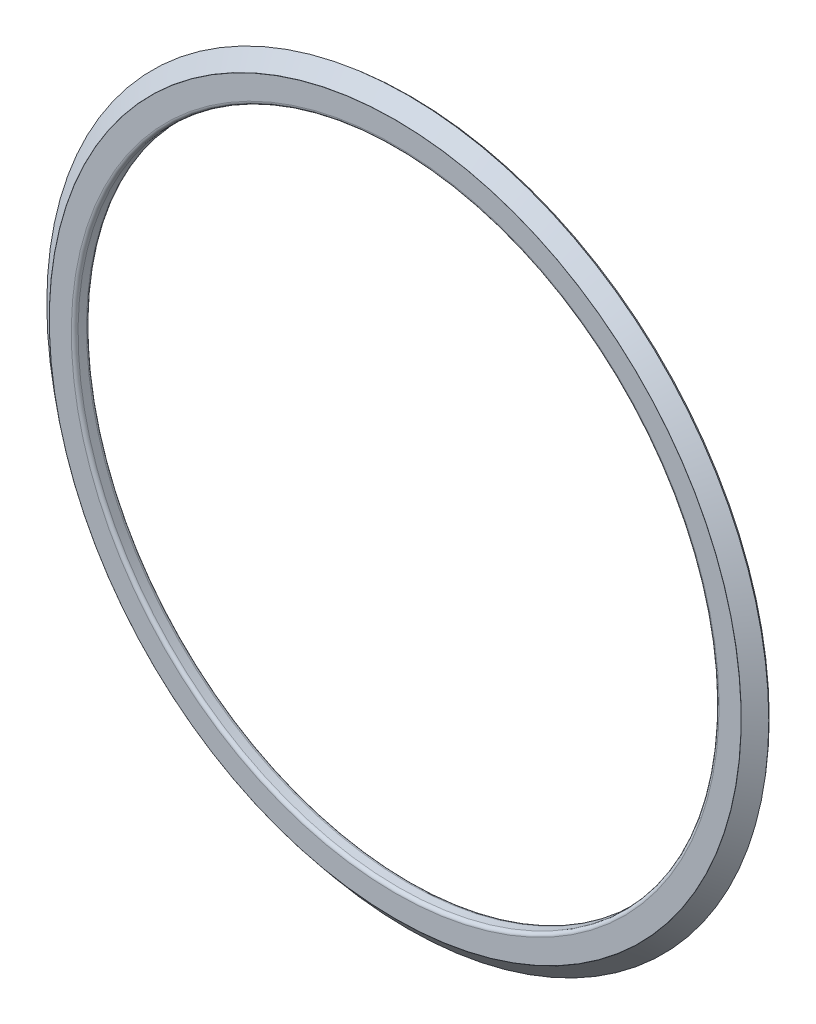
ISO-10303-21;
HEADER;
FILE_DESCRIPTION(('STEP AP214'),'2;1');
FILE_NAME('part.step','',(''),(''),'','','');
FILE_SCHEMA(('AUTOMOTIVE_DESIGN { 1 0 10303 214 1 1 1 1 }'));
ENDSEC;
DATA;
#1=APPLICATION_CONTEXT('core data for automotive mechanical design processes');
#2=APPLICATION_PROTOCOL_DEFINITION('international standard','automotive_design',2000,#1);
#3=PRODUCT_CONTEXT('',#1,'mechanical');
#4=PRODUCT('Part','Part','',(#3));
#5=PRODUCT_RELATED_PRODUCT_CATEGORY('part','',(#4));
#6=PRODUCT_DEFINITION_FORMATION('','',#4);
#7=PRODUCT_DEFINITION_CONTEXT('part definition',#1,'design');
#8=PRODUCT_DEFINITION('design','',#6,#7);
#9=PRODUCT_DEFINITION_SHAPE('','',#8);
#10=(LENGTH_UNIT() NAMED_UNIT(*) SI_UNIT(.MILLI.,.METRE.));
#11=(NAMED_UNIT(*) PLANE_ANGLE_UNIT() SI_UNIT($,.RADIAN.));
#12=(NAMED_UNIT(*) SI_UNIT($,.STERADIAN.) SOLID_ANGLE_UNIT());
#13=UNCERTAINTY_MEASURE_WITH_UNIT(LENGTH_MEASURE(1.E-05),#10,'distance_accuracy_value','');
#14=(GEOMETRIC_REPRESENTATION_CONTEXT(3) GLOBAL_UNCERTAINTY_ASSIGNED_CONTEXT((#13)) GLOBAL_UNIT_ASSIGNED_CONTEXT((#10,
#11,#12)) REPRESENTATION_CONTEXT('',''));
#15=CARTESIAN_POINT('',(0.,0.,0.));
#16=DIRECTION('',(0.,0.,1.));
#17=DIRECTION('',(1.,0.,0.));
#18=AXIS2_PLACEMENT_3D('',#15,#16,#17);
#19=CARTESIAN_POINT('',(0.,5.846852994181E-07,33.5));
#20=DIRECTION('',(0.,-1.74532925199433E-08,-1.));
#21=DIRECTION('',(-0.00155633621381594,-0.999998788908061,1.74532713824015E-08));
#22=AXIS2_PLACEMENT_3D('',#19,#20,#21);
#23=TOROIDAL_SURFACE('',#22,96.,1.);
#24=CARTESIAN_POINT('',(0.,5.846852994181E-07,33.5));
#25=DIRECTION('',(0.,1.74532925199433E-08,1.));
#26=DIRECTION('',(0.,-1.,1.74532925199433E-08));
#27=AXIS2_PLACEMENT_3D('',#24,#25,#26);
#28=CIRCLE('',#27,95.);
#29=CARTESIAN_POINT('',(0.,-94.9999994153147,33.5000016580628));
#30=VERTEX_POINT('',#29);
#31=EDGE_CURVE('E29',#30,#30,#28,.T.);
#32=ORIENTED_EDGE('',*,*,#31,.F.);
#33=EDGE_LOOP('',(#32));
#34=FACE_BOUND('',#33,.T.);
#35=CARTESIAN_POINT('',(0.,6.02138591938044E-07,34.5));
#36=DIRECTION('',(0.,1.74532925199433E-08,1.));
#37=DIRECTION('',(-1.,0.,0.));
#38=AXIS2_PLACEMENT_3D('',#35,#36,#37);
#39=CIRCLE('',#38,96.);
#40=CARTESIAN_POINT('',(0.,-95.9999993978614,34.5000016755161));
#41=VERTEX_POINT('',#40);
#42=EDGE_CURVE('E11',#41,#41,#39,.T.);
#43=ORIENTED_EDGE('',*,*,#42,.T.);
#44=EDGE_LOOP('',(#43));
#45=FACE_BOUND('',#44,.T.);
#46=ADVANCED_FACE('F18',(#34,#45),#23,.T.);
#47=CARTESIAN_POINT('',(0.,6.06065582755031E-07,34.725));
#48=DIRECTION('',(0.,-1.74532925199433E-08,-1.));
#49=DIRECTION('',(0.,-1.,1.74532925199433E-08));
#50=AXIS2_PLACEMENT_3D('',#47,#48,#49);
#51=CYLINDRICAL_SURFACE('',#50,95.);
#52=CARTESIAN_POINT('',(0.,5.41052068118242E-07,31.));
#53=DIRECTION('',(0.,1.74532925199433E-08,1.));
#54=DIRECTION('',(0.,-1.,1.74532925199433E-08));
#55=AXIS2_PLACEMENT_3D('',#52,#53,#54);
#56=CIRCLE('',#55,95.);
#57=CARTESIAN_POINT('',(0.,-94.9999994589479,31.0000016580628));
#58=VERTEX_POINT('',#57);
#59=EDGE_CURVE('E166',#58,#58,#56,.T.);
#60=ORIENTED_EDGE('',*,*,#59,.F.);
#61=EDGE_LOOP('',(#60));
#62=FACE_BOUND('',#61,.T.);
#63=ORIENTED_EDGE('',*,*,#31,.T.);
#64=EDGE_LOOP('',(#63));
#65=FACE_BOUND('',#64,.T.);
#66=ADVANCED_FACE('F212',(#62,#65),#51,.F.);
#67=CARTESIAN_POINT('',(0.,5.41052068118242E-07,31.));
#68=DIRECTION('',(0.,-1.74532925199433E-08,-1.));
#69=DIRECTION('',(-0.00229932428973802,-0.999997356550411,1.74532463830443E-08));
#70=AXIS2_PLACEMENT_3D('',#67,#68,#69);
#71=TOROIDAL_SURFACE('',#70,96.,1.);
#72=CARTESIAN_POINT('',(0.,5.23598775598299E-07,30.));
#73=DIRECTION('',(0.,1.74532925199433E-08,1.));
#74=DIRECTION('',(-1.,0.,0.));
#75=AXIS2_PLACEMENT_3D('',#72,#73,#74);
#76=CIRCLE('',#75,96.);
#77=CARTESIAN_POINT('',(0.,-95.9999994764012,30.0000016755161));
#78=VERTEX_POINT('',#77);
#79=EDGE_CURVE('E141',#78,#78,#76,.T.);
#80=ORIENTED_EDGE('',*,*,#79,.F.);
#81=EDGE_LOOP('',(#80));
#82=FACE_BOUND('',#81,.T.);
#83=ORIENTED_EDGE('',*,*,#59,.T.);
#84=EDGE_LOOP('',(#83));
#85=FACE_BOUND('',#84,.T.);
#86=ADVANCED_FACE('F20',(#82,#85),#71,.T.);
#87=CARTESIAN_POINT('',(0.,5.23598775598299E-07,30.));
#88=DIRECTION('',(0.,-1.74532925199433E-08,-1.));
#89=DIRECTION('',(0.,-1.,1.74532925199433E-08));
#90=AXIS2_PLACEMENT_3D('',#87,#88,#89);
#91=PLANE('',#90);
#92=CARTESIAN_POINT('',(0.,5.23598775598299E-07,30.));
#93=DIRECTION('',(0.,1.74532925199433E-08,1.));
#94=DIRECTION('',(0.,-1.,1.74532925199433E-08));
#95=AXIS2_PLACEMENT_3D('',#92,#93,#94);
#96=CIRCLE('',#95,97.5);
#97=CARTESIAN_POINT('',(0.,-97.4999994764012,30.000001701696));
#98=VERTEX_POINT('',#97);
#99=EDGE_CURVE('E142',#98,#98,#96,.T.);
#100=ORIENTED_EDGE('',*,*,#99,.F.);
#101=EDGE_LOOP('',(#100));
#102=FACE_BOUND('',#101,.T.);
#103=ORIENTED_EDGE('',*,*,#79,.T.);
#104=EDGE_LOOP('',(#103));
#105=FACE_BOUND('',#104,.T.);
#106=ADVANCED_FACE('F208',(#102,#105),#91,.T.);
#107=CARTESIAN_POINT('',(0.,6.06065582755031E-07,34.725));
#108=DIRECTION('',(0.,-1.74532925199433E-08,-1.));
#109=DIRECTION('',(0.,-1.,1.74532925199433E-08));
#110=AXIS2_PLACEMENT_3D('',#107,#108,#109);
#111=CYLINDRICAL_SURFACE('',#110,97.5);
#112=CARTESIAN_POINT('',(0.,5.37561409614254E-07,30.8));
#113=DIRECTION('',(0.,-1.74532925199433E-08,-1.));
#114=DIRECTION('',(0.,-1.,1.74532925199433E-08));
#115=AXIS2_PLACEMENT_3D('',#112,#113,#114);
#116=CIRCLE('',#115,97.5);
#117=CARTESIAN_POINT('',(0.,97.5000005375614,30.799998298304));
#118=VERTEX_POINT('',#117);
#119=EDGE_CURVE('E137',#118,#118,#116,.T.);
#120=ORIENTED_EDGE('',*,*,#119,.T.);
#121=EDGE_LOOP('',(#120));
#122=FACE_BOUND('',#121,.T.);
#123=ORIENTED_EDGE('',*,*,#99,.T.);
#124=EDGE_LOOP('',(#123));
#125=FACE_BOUND('',#124,.T.);
#126=ADVANCED_FACE('F254',(#122,#125),#111,.T.);
#127=CARTESIAN_POINT('',(0.,5.37561409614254E-07,30.8));
#128=DIRECTION('',(0.,-1.74532925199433E-08,-1.));
#129=DIRECTION('',(0.,-1.,1.74532925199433E-08));
#130=AXIS2_PLACEMENT_3D('',#127,#128,#129);
#131=PLANE('',#130);
#132=CARTESIAN_POINT('',(0.,5.37561409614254E-07,30.8));
#133=DIRECTION('',(0.,-1.74532925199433E-08,-1.));
#134=DIRECTION('',(0.,-1.,1.74532925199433E-08));
#135=AXIS2_PLACEMENT_3D('',#132,#133,#134);
#136=CIRCLE('',#135,100.399999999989);
#137=CARTESIAN_POINT('',(0.,-100.399999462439,30.8000017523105));
#138=VERTEX_POINT('',#137);
#139=EDGE_CURVE('E165',#138,#138,#136,.T.);
#140=ORIENTED_EDGE('',*,*,#139,.T.);
#141=EDGE_LOOP('',(#140));
#142=FACE_BOUND('',#141,.T.);
#143=ORIENTED_EDGE('',*,*,#119,.F.);
#144=EDGE_LOOP('',(#143));
#145=FACE_BOUND('',#144,.T.);
#146=ADVANCED_FACE('F230',(#142,#145),#131,.T.);
#147=CARTESIAN_POINT('',(0.,5.21853446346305E-07,29.9));
#148=DIRECTION('',(0.,-1.74532925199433E-08,-1.));
#149=DIRECTION('',(0.,-1.,1.74532925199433E-08));
#150=AXIS2_PLACEMENT_3D('',#147,#148,#149);
#151=CONICAL_SURFACE('',#150,101.9588457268,1.0471975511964);
#152=CARTESIAN_POINT('',(0.,5.06145483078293E-07,28.9999999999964));
#153=DIRECTION('',(0.,-1.74532925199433E-08,-1.));
#154=DIRECTION('',(0.,1.,-1.74532925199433E-08));
#155=AXIS2_PLACEMENT_3D('',#152,#153,#154);
#156=CIRCLE('',#155,103.517691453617);
#157=CARTESIAN_POINT('',(0.,-103.517690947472,29.000001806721));
#158=VERTEX_POINT('',#157);
#159=EDGE_CURVE('E161',#158,#158,#156,.T.);
#160=ORIENTED_EDGE('',*,*,#159,.T.);
#161=EDGE_LOOP('',(#160));
#162=FACE_BOUND('',#161,.T.);
#163=ORIENTED_EDGE('',*,*,#139,.F.);
#164=EDGE_LOOP('',(#163));
#165=FACE_BOUND('',#164,.T.);
#166=ADVANCED_FACE('F226',(#162,#165),#151,.F.);
#167=CARTESIAN_POINT('',(0.,5.11071399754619E-07,29.282234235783));
#168=DIRECTION('',(0.,1.74532925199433E-08,1.));
#169=DIRECTION('',(0.,1.,-1.74532925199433E-08));
#170=AXIS2_PLACEMENT_3D('',#167,#168,#169);
#171=CONICAL_SURFACE('',#170,103.7080608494,0.59341194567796);
#172=ORIENTED_EDGE('',*,*,#159,.F.);
#173=EDGE_LOOP('',(#172));
#174=FACE_BOUND('',#173,.T.);
#175=CARTESIAN_POINT('',(0.,5.15997316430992E-07,29.5644684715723));
#176=DIRECTION('',(0.,-1.74532925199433E-08,-1.));
#177=DIRECTION('',(0.,1.,-1.74532925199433E-08));
#178=AXIS2_PLACEMENT_3D('',#175,#176,#177);
#179=CIRCLE('',#178,103.898430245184);
#180=CARTESIAN_POINT('',(0.,103.898430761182,29.5644666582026));
#181=VERTEX_POINT('',#180);
#182=EDGE_CURVE('E153',#181,#181,#179,.T.);
#183=ORIENTED_EDGE('',*,*,#182,.T.);
#184=EDGE_LOOP('',(#183));
#185=FACE_BOUND('',#184,.T.);
#186=ADVANCED_FACE('F229',(#174,#185),#171,.T.);
#187=CARTESIAN_POINT('',(0.,5.4161466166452E-07,31.032234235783));
#188=DIRECTION('',(0.,-1.74532925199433E-08,-1.));
#189=DIRECTION('',(0.,-1.,1.74532925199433E-08));
#190=AXIS2_PLACEMENT_3D('',#187,#188,#189);
#191=CONICAL_SURFACE('',#190,102.1492151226,0.872664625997);
#192=CARTESIAN_POINT('',(0.,5.67232006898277E-07,32.5000000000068));
#193=DIRECTION('',(0.,-1.74532925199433E-08,-1.));
#194=DIRECTION('',(0.,-1.,1.74532925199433E-08));
#195=AXIS2_PLACEMENT_3D('',#192,#193,#194);
#196=CIRCLE('',#195,100.4);
#197=CARTESIAN_POINT('',(0.,-100.399999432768,32.5000017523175));
#198=VERTEX_POINT('',#197);
#199=EDGE_CURVE('E149',#198,#198,#196,.T.);
#200=ORIENTED_EDGE('',*,*,#199,.T.);
#201=EDGE_LOOP('',(#200));
#202=FACE_BOUND('',#201,.T.);
#203=ORIENTED_EDGE('',*,*,#182,.F.);
#204=EDGE_LOOP('',(#203));
#205=FACE_BOUND('',#204,.T.);
#206=ADVANCED_FACE('F264',(#202,#205),#191,.T.);
#207=CARTESIAN_POINT('',(0.,5.88612290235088E-07,33.725));
#208=DIRECTION('',(0.,-1.74532925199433E-08,-1.));
#209=DIRECTION('',(0.,-1.,1.74532925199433E-08));
#210=AXIS2_PLACEMENT_3D('',#207,#208,#209);
#211=CYLINDRICAL_SURFACE('',#210,100.4);
#212=CARTESIAN_POINT('',(0.,5.82939970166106E-07,33.4));
#213=DIRECTION('',(0.,1.74532925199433E-08,1.));
#214=DIRECTION('',(0.,-1.,1.74532925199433E-08));
#215=AXIS2_PLACEMENT_3D('',#212,#213,#214);
#216=CIRCLE('',#215,100.4);
#217=CARTESIAN_POINT('',(0.,-100.39999941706,33.4000017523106));
#218=VERTEX_POINT('',#217);
#219=EDGE_CURVE('E159',#218,#218,#216,.T.);
#220=ORIENTED_EDGE('',*,*,#219,.F.);
#221=EDGE_LOOP('',(#220));
#222=FACE_BOUND('',#221,.T.);
#223=ORIENTED_EDGE('',*,*,#199,.F.);
#224=EDGE_LOOP('',(#223));
#225=FACE_BOUND('',#224,.T.);
#226=ADVANCED_FACE('F266',(#222,#225),#211,.T.);
#227=CARTESIAN_POINT('',(0.,5.82939970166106E-07,33.4));
#228=DIRECTION('',(0.,-1.74532925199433E-08,-1.));
#229=DIRECTION('',(-0.00217565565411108,-0.999997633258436,1.74532512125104E-08));
#230=AXIS2_PLACEMENT_3D('',#227,#228,#229);
#231=TOROIDAL_SURFACE('',#230,100.3,0.1);
#232=CARTESIAN_POINT('',(0.,5.846852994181E-07,33.5));
#233=DIRECTION('',(0.,-1.74532925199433E-08,-1.));
#234=DIRECTION('',(-1.,0.,0.));
#235=AXIS2_PLACEMENT_3D('',#232,#233,#234);
#236=CIRCLE('',#235,100.3);
#237=CARTESIAN_POINT('',(1.392902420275E-12,-100.299999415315,33.5000017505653));
#238=VERTEX_POINT('',#237);
#239=EDGE_CURVE('E154',#238,#238,#236,.T.);
#240=ORIENTED_EDGE('',*,*,#239,.T.);
#241=EDGE_LOOP('',(#240));
#242=FACE_BOUND('',#241,.T.);
#243=ORIENTED_EDGE('',*,*,#219,.T.);
#244=EDGE_LOOP('',(#243));
#245=FACE_BOUND('',#244,.T.);
#246=ADVANCED_FACE('F224',(#242,#245),#231,.T.);
#247=CARTESIAN_POINT('',(0.,5.846852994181E-07,33.5));
#248=DIRECTION('',(0.,-1.74532925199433E-08,-1.));
#249=DIRECTION('',(0.,-1.,1.74532925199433E-08));
#250=AXIS2_PLACEMENT_3D('',#247,#248,#249);
#251=PLANE('',#250);
#252=CARTESIAN_POINT('',(0.,5.846852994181E-07,33.5));
#253=DIRECTION('',(0.,-1.74532925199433E-08,-1.));
#254=DIRECTION('',(0.,-1.,1.74532925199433E-08));
#255=AXIS2_PLACEMENT_3D('',#252,#253,#254);
#256=CIRCLE('',#255,102.186074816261);
#257=CARTESIAN_POINT('',(0.,-102.186074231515,33.5000017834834));
#258=VERTEX_POINT('',#257);
#259=EDGE_CURVE('E155',#258,#258,#256,.T.);
#260=ORIENTED_EDGE('',*,*,#259,.T.);
#261=EDGE_LOOP('',(#260));
#262=FACE_BOUND('',#261,.T.);
#263=ORIENTED_EDGE('',*,*,#239,.F.);
#264=EDGE_LOOP('',(#263));
#265=FACE_BOUND('',#264,.T.);
#266=ADVANCED_FACE('F258',(#262,#265),#251,.T.);
#267=CARTESIAN_POINT('',(0.,5.541420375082E-07,31.75));
#268=DIRECTION('',(0.,-1.74532925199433E-08,-1.));
#269=DIRECTION('',(0.,-1.,1.74532925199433E-08));
#270=AXIS2_PLACEMENT_3D('',#267,#268,#269);
#271=CONICAL_SURFACE('',#270,104.2716436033,0.872664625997);
#272=CARTESIAN_POINT('',(0.,5.23598775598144E-07,29.9999999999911));
#273=DIRECTION('',(0.,-1.74532925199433E-08,-1.));
#274=DIRECTION('',(0.,1.,-1.74532925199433E-08));
#275=AXIS2_PLACEMENT_3D('',#272,#273,#274);
#276=CIRCLE('',#275,106.35721239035);
#277=CARTESIAN_POINT('',(0.,-106.357211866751,30.0000018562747));
#278=VERTEX_POINT('',#277);
#279=EDGE_CURVE('E160',#278,#278,#276,.T.);
#280=ORIENTED_EDGE('',*,*,#279,.T.);
#281=EDGE_LOOP('',(#280));
#282=FACE_BOUND('',#281,.T.);
#283=ORIENTED_EDGE('',*,*,#259,.F.);
#284=EDGE_LOOP('',(#283));
#285=FACE_BOUND('',#284,.T.);
#286=ADVANCED_FACE('F236',(#282,#285),#271,.F.);
#287=CARTESIAN_POINT('',(0.,5.30283774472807E-07,30.383022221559));
#288=DIRECTION('',(0.,1.74532925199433E-08,1.));
#289=DIRECTION('',(0.,1.,-1.74532925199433E-08));
#290=AXIS2_PLACEMENT_3D('',#287,#288,#289);
#291=CONICAL_SURFACE('',#290,106.6786061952,0.6981317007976);
#292=ORIENTED_EDGE('',*,*,#279,.F.);
#293=EDGE_LOOP('',(#292));
#294=FACE_BOUND('',#293,.T.);
#295=CARTESIAN_POINT('',(0.,5.36968773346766E-07,30.7660444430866));
#296=DIRECTION('',(0.,1.74532925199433E-08,1.));
#297=DIRECTION('',(0.,1.,-1.74532925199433E-08));
#298=AXIS2_PLACEMENT_3D('',#295,#296,#297);
#299=CIRCLE('',#298,107.000000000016);
#300=CARTESIAN_POINT('',(0.,107.000000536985,30.7660425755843));
#301=VERTEX_POINT('',#300);
#302=EDGE_CURVE('E170',#301,#301,#299,.T.);
#303=ORIENTED_EDGE('',*,*,#302,.F.);
#304=EDGE_LOOP('',(#303));
#305=FACE_BOUND('',#304,.T.);
#306=ADVANCED_FACE('F232',(#294,#305),#291,.T.);
#307=CARTESIAN_POINT('',(0.,5.69349517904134E-07,32.621324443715));
#308=DIRECTION('',(0.,-1.74532925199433E-08,-1.));
#309=DIRECTION('',(0.,-1.,1.74532925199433E-08));
#310=AXIS2_PLACEMENT_3D('',#307,#308,#309);
#311=CONICAL_SURFACE('',#310,104.788963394,0.872664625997);
#312=CARTESIAN_POINT('',(0.,6.01730262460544E-07,34.4766044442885));
#313=DIRECTION('',(0.,1.74532925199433E-08,1.));
#314=DIRECTION('',(0.,-1.,1.74532925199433E-08));
#315=AXIS2_PLACEMENT_3D('',#312,#313,#314);
#316=CIRCLE('',#315,102.577926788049);
#317=CARTESIAN_POINT('',(3.769218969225E-13,102.57792738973,34.4766026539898));
#318=VERTEX_POINT('',#317);
#319=EDGE_CURVE('E146',#318,#318,#316,.T.);
#320=ORIENTED_EDGE('',*,*,#319,.F.);
#321=EDGE_LOOP('',(#320));
#322=FACE_BOUND('',#321,.T.);
#323=ORIENTED_EDGE('',*,*,#302,.T.);
#324=EDGE_LOOP('',(#323));
#325=FACE_BOUND('',#324,.T.);
#326=ADVANCED_FACE('F235',(#322,#325),#311,.T.);
#327=CARTESIAN_POINT('',(0.,6.0039326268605E-07,34.4));
#328=DIRECTION('',(0.,-1.74532925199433E-08,-1.));
#329=DIRECTION('',(-0.00208480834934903,-0.999997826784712,1.74532545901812E-08));
#330=AXIS2_PLACEMENT_3D('',#327,#328,#329);
#331=TOROIDAL_SURFACE('',#330,102.5136480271,0.1);
#332=CARTESIAN_POINT('',(0.,6.02138591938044E-07,34.5));
#333=DIRECTION('',(0.,1.74532925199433E-08,1.));
#334=DIRECTION('',(-1.,0.,0.));
#335=AXIS2_PLACEMENT_3D('',#332,#333,#334);
#336=CIRCLE('',#335,102.5136480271);
#337=CARTESIAN_POINT('',(0.,-102.513647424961,34.5000017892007));
#338=VERTEX_POINT('',#337);
#339=EDGE_CURVE('E143',#338,#338,#336,.T.);
#340=ORIENTED_EDGE('',*,*,#339,.F.);
#341=EDGE_LOOP('',(#340));
#342=FACE_BOUND('',#341,.T.);
#343=ORIENTED_EDGE('',*,*,#319,.T.);
#344=EDGE_LOOP('',(#343));
#345=FACE_BOUND('',#344,.T.);
#346=ADVANCED_FACE('F251',(#342,#345),#331,.T.);
#347=CARTESIAN_POINT('',(0.,6.02138591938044E-07,34.5));
#348=DIRECTION('',(0.,-1.74532925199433E-08,-1.));
#349=DIRECTION('',(0.,-1.,1.74532925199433E-08));
#350=AXIS2_PLACEMENT_3D('',#347,#348,#349);
#351=PLANE('',#350);
#352=ORIENTED_EDGE('',*,*,#339,.T.);
#353=EDGE_LOOP('',(#352));
#354=FACE_BOUND('',#353,.T.);
#355=ORIENTED_EDGE('',*,*,#42,.F.);
#356=EDGE_LOOP('',(#355));
#357=FACE_BOUND('',#356,.T.);
#358=ADVANCED_FACE('F309',(#354,#357),#351,.F.);
#359=CLOSED_SHELL('',(#46,#66,#86,#106,#126,#146,#166,#186,#206,#226,#246,#266,#286,#306,#326,
#346,#358));
#360=CARTESIAN_POINT('',(0.,5.86605161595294E-07,33.61));
#361=DIRECTION('',(0.,-1.74532925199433E-08,-1.));
#362=DIRECTION('',(0.,-1.,1.74532925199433E-08));
#363=AXIS2_PLACEMENT_3D('',#360,#361,#362);
#364=CYLINDRICAL_SURFACE('',#363,98.9);
#365=CARTESIAN_POINT('',(0.,5.846852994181E-07,33.5));
#366=DIRECTION('',(0.,-1.74532925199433E-08,-1.));
#367=DIRECTION('',(0.,-1.,1.74532925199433E-08));
#368=AXIS2_PLACEMENT_3D('',#365,#366,#367);
#369=CIRCLE('',#368,98.9);
#370=CARTESIAN_POINT('',(0.,-98.8999994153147,33.5000017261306));
#371=VERTEX_POINT('',#370);
#372=EDGE_CURVE('E147',#371,#371,#369,.T.);
#373=ORIENTED_EDGE('',*,*,#372,.F.);
#374=EDGE_LOOP('',(#373));
#375=FACE_BOUND('',#374,.T.);
#376=CARTESIAN_POINT('',(0.,5.75958653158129E-07,33.));
#377=DIRECTION('',(0.,1.74532925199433E-08,1.));
#378=DIRECTION('',(0.,-1.,1.74532925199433E-08));
#379=AXIS2_PLACEMENT_3D('',#376,#377,#378);
#380=CIRCLE('',#379,98.9);
#381=CARTESIAN_POINT('',(0.,-98.8999994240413,33.0000017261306));
#382=VERTEX_POINT('',#381);
#383=EDGE_CURVE('E178',#382,#382,#380,.T.);
#384=ORIENTED_EDGE('',*,*,#383,.F.);
#385=EDGE_LOOP('',(#384));
#386=FACE_BOUND('',#385,.T.);
#387=ADVANCED_FACE('F315',(#375,#386),#364,.F.);
#388=CARTESIAN_POINT('',(0.,5.846852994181E-07,33.5));
#389=DIRECTION('',(0.,-1.74532925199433E-08,-1.));
#390=DIRECTION('',(0.,-1.,1.74532925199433E-08));
#391=AXIS2_PLACEMENT_3D('',#388,#389,#390);
#392=PLANE('',#391);
#393=ORIENTED_EDGE('',*,*,#372,.T.);
#394=EDGE_LOOP('',(#393));
#395=FACE_BOUND('',#394,.T.);
#396=CARTESIAN_POINT('',(0.,5.846852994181E-07,33.5));
#397=DIRECTION('',(0.,-1.74532925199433E-08,-1.));
#398=DIRECTION('',(-1.,0.,0.));
#399=AXIS2_PLACEMENT_3D('',#396,#397,#398);
#400=CIRCLE('',#399,97.);
#401=CARTESIAN_POINT('',(0.,97.0000005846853,33.4999983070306));
#402=VERTEX_POINT('',#401);
#403=EDGE_CURVE('E131',#402,#402,#400,.T.);
#404=ORIENTED_EDGE('',*,*,#403,.F.);
#405=EDGE_LOOP('',(#404));
#406=FACE_BOUND('',#405,.T.);
#407=ADVANCED_FACE('F318',(#395,#406),#392,.T.);
#408=CARTESIAN_POINT('',(0.,5.75958653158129E-07,33.));
#409=DIRECTION('',(0.,-1.74532925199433E-08,-1.));
#410=DIRECTION('',(0.,-1.,1.74532925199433E-08));
#411=AXIS2_PLACEMENT_3D('',#408,#409,#410);
#412=PLANE('',#411);
#413=CARTESIAN_POINT('',(0.,5.75958653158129E-07,33.));
#414=DIRECTION('',(0.,-1.74532925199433E-08,-1.));
#415=DIRECTION('',(0.,-1.,1.74532925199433E-08));
#416=AXIS2_PLACEMENT_3D('',#413,#414,#415);
#417=CIRCLE('',#416,99.4);
#418=CARTESIAN_POINT('',(0.,99.4000005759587,32.9999982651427));
#419=VERTEX_POINT('',#418);
#420=EDGE_CURVE('E195',#419,#419,#417,.T.);
#421=ORIENTED_EDGE('',*,*,#420,.T.);
#422=EDGE_LOOP('',(#421));
#423=FACE_BOUND('',#422,.T.);
#424=ORIENTED_EDGE('',*,*,#383,.T.);
#425=EDGE_LOOP('',(#424));
#426=FACE_BOUND('',#425,.T.);
#427=ADVANCED_FACE('F242',(#423,#426),#412,.T.);
#428=CARTESIAN_POINT('',(0.,5.86605161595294E-07,33.61));
#429=DIRECTION('',(0.,-1.74532925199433E-08,-1.));
#430=DIRECTION('',(0.,-1.,1.74532925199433E-08));
#431=AXIS2_PLACEMENT_3D('',#428,#429,#430);
#432=CYLINDRICAL_SURFACE('',#431,99.4);
#433=CARTESIAN_POINT('',(0.,5.46288055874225E-07,31.3));
#434=DIRECTION('',(0.,-1.74532925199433E-08,-1.));
#435=DIRECTION('',(0.,-1.,1.74532925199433E-08));
#436=AXIS2_PLACEMENT_3D('',#433,#434,#435);
#437=CIRCLE('',#436,99.4);
#438=CARTESIAN_POINT('',(0.,-99.3999994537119,31.3000017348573));
#439=VERTEX_POINT('',#438);
#440=EDGE_CURVE('E174',#439,#439,#437,.T.);
#441=ORIENTED_EDGE('',*,*,#440,.T.);
#442=EDGE_LOOP('',(#441));
#443=FACE_BOUND('',#442,.T.);
#444=ORIENTED_EDGE('',*,*,#420,.F.);
#445=EDGE_LOOP('',(#444));
#446=FACE_BOUND('',#445,.T.);
#447=ADVANCED_FACE('F238',(#443,#446),#432,.F.);
#448=CARTESIAN_POINT('',(0.,5.46288055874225E-07,31.3));
#449=DIRECTION('',(0.,-1.74532925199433E-08,-1.));
#450=DIRECTION('',(0.,-1.,1.74532925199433E-08));
#451=AXIS2_PLACEMENT_3D('',#448,#449,#450);
#452=PLANE('',#451);
#453=ORIENTED_EDGE('',*,*,#440,.F.);
#454=EDGE_LOOP('',(#453));
#455=FACE_BOUND('',#454,.T.);
#456=CARTESIAN_POINT('',(0.,5.46288055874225E-07,31.3));
#457=DIRECTION('',(0.,-1.74532925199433E-08,-1.));
#458=DIRECTION('',(0.,-1.,1.74532925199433E-08));
#459=AXIS2_PLACEMENT_3D('',#456,#457,#458);
#460=CIRCLE('',#459,96.5);
#461=CARTESIAN_POINT('',(0.,-96.4999994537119,31.3000016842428));
#462=VERTEX_POINT('',#461);
#463=EDGE_CURVE('E179',#462,#462,#460,.T.);
#464=ORIENTED_EDGE('',*,*,#463,.T.);
#465=EDGE_LOOP('',(#464));
#466=FACE_BOUND('',#465,.T.);
#467=ADVANCED_FACE('F241',(#455,#466),#452,.F.);
#468=CARTESIAN_POINT('',(0.,5.86605161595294E-07,33.61));
#469=DIRECTION('',(0.,-1.74532925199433E-08,-1.));
#470=DIRECTION('',(0.,-1.,1.74532925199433E-08));
#471=AXIS2_PLACEMENT_3D('',#468,#469,#470);
#472=CYLINDRICAL_SURFACE('',#471,96.5);
#473=CARTESIAN_POINT('',(0.,5.63741348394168E-07,32.3));
#474=DIRECTION('',(0.,1.74532925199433E-08,1.));
#475=DIRECTION('',(0.,-1.,1.74532925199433E-08));
#476=AXIS2_PLACEMENT_3D('',#473,#474,#475);
#477=CIRCLE('',#476,96.5);
#478=CARTESIAN_POINT('',(0.,-96.4999994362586,32.3000016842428));
#479=VERTEX_POINT('',#478);
#480=EDGE_CURVE('E22',#479,#479,#477,.T.);
#481=ORIENTED_EDGE('',*,*,#480,.F.);
#482=EDGE_LOOP('',(#481));
#483=FACE_BOUND('',#482,.T.);
#484=ORIENTED_EDGE('',*,*,#463,.F.);
#485=EDGE_LOOP('',(#484));
#486=FACE_BOUND('',#485,.T.);
#487=ADVANCED_FACE('F262',(#483,#486),#472,.T.);
#488=CARTESIAN_POINT('',(0.,5.63741348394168E-07,32.3));
#489=DIRECTION('',(0.,-1.74532925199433E-08,-1.));
#490=DIRECTION('',(0.,-1.,1.74532925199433E-08));
#491=AXIS2_PLACEMENT_3D('',#488,#489,#490);
#492=PLANE('',#491);
#493=ORIENTED_EDGE('',*,*,#480,.T.);
#494=EDGE_LOOP('',(#493));
#495=FACE_BOUND('',#494,.T.);
#496=CARTESIAN_POINT('',(0.,5.63741348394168E-07,32.3));
#497=DIRECTION('',(0.,-1.74532925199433E-08,-1.));
#498=DIRECTION('',(0.,-1.,1.74532925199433E-08));
#499=AXIS2_PLACEMENT_3D('',#496,#497,#498);
#500=CIRCLE('',#499,96.);
#501=CARTESIAN_POINT('',(0.,-95.9999994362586,32.3000016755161));
#502=VERTEX_POINT('',#501);
#503=EDGE_CURVE('E109',#502,#502,#500,.T.);
#504=ORIENTED_EDGE('',*,*,#503,.T.);
#505=EDGE_LOOP('',(#504));
#506=FACE_BOUND('',#505,.T.);
#507=ADVANCED_FACE('F249',(#495,#506),#492,.F.);
#508=CARTESIAN_POINT('',(0.,6.06065582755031E-07,34.725));
#509=DIRECTION('',(0.,-1.74532925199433E-08,-1.));
#510=DIRECTION('',(0.,-1.,1.74532925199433E-08));
#511=AXIS2_PLACEMENT_3D('',#508,#509,#510);
#512=CYLINDRICAL_SURFACE('',#511,96.);
#513=ORIENTED_EDGE('',*,*,#503,.F.);
#514=EDGE_LOOP('',(#513));
#515=FACE_BOUND('',#514,.T.);
#516=CARTESIAN_POINT('',(0.,5.67232006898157E-07,32.5));
#517=DIRECTION('',(0.,-1.74532925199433E-08,-1.));
#518=DIRECTION('',(0.,-1.,1.74532925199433E-08));
#519=AXIS2_PLACEMENT_3D('',#516,#517,#518);
#520=CIRCLE('',#519,96.);
#521=CARTESIAN_POINT('',(0.,-95.999999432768,32.5000016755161));
#522=VERTEX_POINT('',#521);
#523=EDGE_CURVE('E135',#522,#522,#520,.T.);
#524=ORIENTED_EDGE('',*,*,#523,.T.);
#525=EDGE_LOOP('',(#524));
#526=FACE_BOUND('',#525,.T.);
#527=ADVANCED_FACE('F245',(#515,#526),#512,.T.);
#528=CARTESIAN_POINT('',(0.,5.67232006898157E-07,32.5));
#529=DIRECTION('',(0.,-1.74532925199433E-08,-1.));
#530=DIRECTION('',(0.00160174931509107,-0.999998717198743,1.74532701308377E-08));
#531=AXIS2_PLACEMENT_3D('',#528,#529,#530);
#532=TOROIDAL_SURFACE('',#531,97.,1.);
#533=ORIENTED_EDGE('',*,*,#403,.T.);
#534=EDGE_LOOP('',(#533));
#535=FACE_BOUND('',#534,.T.);
#536=ORIENTED_EDGE('',*,*,#523,.F.);
#537=EDGE_LOOP('',(#536));
#538=FACE_BOUND('',#537,.T.);
#539=ADVANCED_FACE('F248',(#535,#538),#532,.F.);
#540=CLOSED_SHELL('',(#387,#407,#427,#447,#467,#487,#507,#527,#539));
#541=CARTESIAN_POINT('',(0.,5.44542726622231E-07,31.2));
#542=DIRECTION('',(0.,-1.74532925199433E-08,-1.));
#543=DIRECTION('',(0.,-1.,1.74532925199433E-08));
#544=AXIS2_PLACEMENT_3D('',#541,#542,#543);
#545=TOROIDAL_SURFACE('',#544,96.,0.4);
#546=CARTESIAN_POINT('',(0.,5.37561409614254E-07,30.8));
#547=DIRECTION('',(0.,-1.74532925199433E-08,-1.));
#548=DIRECTION('',(0.,-1.,1.74532925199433E-08));
#549=AXIS2_PLACEMENT_3D('',#546,#547,#548);
#550=CIRCLE('',#549,96.);
#551=CARTESIAN_POINT('',(0.,-95.9999994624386,30.8000016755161));
#552=VERTEX_POINT('',#551);
#553=EDGE_CURVE('E120',#552,#552,#550,.T.);
#554=ORIENTED_EDGE('',*,*,#553,.F.);
#555=EDGE_LOOP('',(#554));
#556=FACE_BOUND('',#555,.T.);
#557=CARTESIAN_POINT('',(0.,5.51524043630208E-07,31.6));
#558=DIRECTION('',(0.,-1.74532925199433E-08,-1.));
#559=DIRECTION('',(0.,-1.,1.74532925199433E-08));
#560=AXIS2_PLACEMENT_3D('',#557,#558,#559);
#561=CIRCLE('',#560,96.);
#562=CARTESIAN_POINT('',(0.,-95.9999994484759,31.6000016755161));
#563=VERTEX_POINT('',#562);
#564=EDGE_CURVE('E125',#563,#563,#561,.T.);
#565=ORIENTED_EDGE('',*,*,#564,.T.);
#566=EDGE_LOOP('',(#565));
#567=FACE_BOUND('',#566,.T.);
#568=ADVANCED_FACE('F121',(#556,#567),#545,.F.);
#569=CARTESIAN_POINT('',(0.,5.88612290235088E-07,33.725));
#570=DIRECTION('',(0.,-1.74532925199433E-08,-1.));
#571=DIRECTION('',(0.,-1.,1.74532925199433E-08));
#572=AXIS2_PLACEMENT_3D('',#569,#570,#571);
#573=CYLINDRICAL_SURFACE('',#572,96.);
#574=ORIENTED_EDGE('',*,*,#553,.T.);
#575=EDGE_LOOP('',(#574));
#576=FACE_BOUND('',#575,.T.);
#577=ORIENTED_EDGE('',*,*,#564,.F.);
#578=EDGE_LOOP('',(#577));
#579=FACE_BOUND('',#578,.T.);
#580=ADVANCED_FACE('F325',(#576,#579),#573,.F.);
#581=CLOSED_SHELL('',(#568,#580));
#582=ORIENTED_CLOSED_SHELL('',*,#540,.T.);
#583=ORIENTED_CLOSED_SHELL('',*,#581,.T.);
#584=BREP_WITH_VOIDS('B1',#359,(#582,#583));
#585=ADVANCED_BREP_SHAPE_REPRESENTATION('',(#18,#584),#14);
#586=SHAPE_DEFINITION_REPRESENTATION(#9,#585);
ENDSEC;
END-ISO-10303-21;
